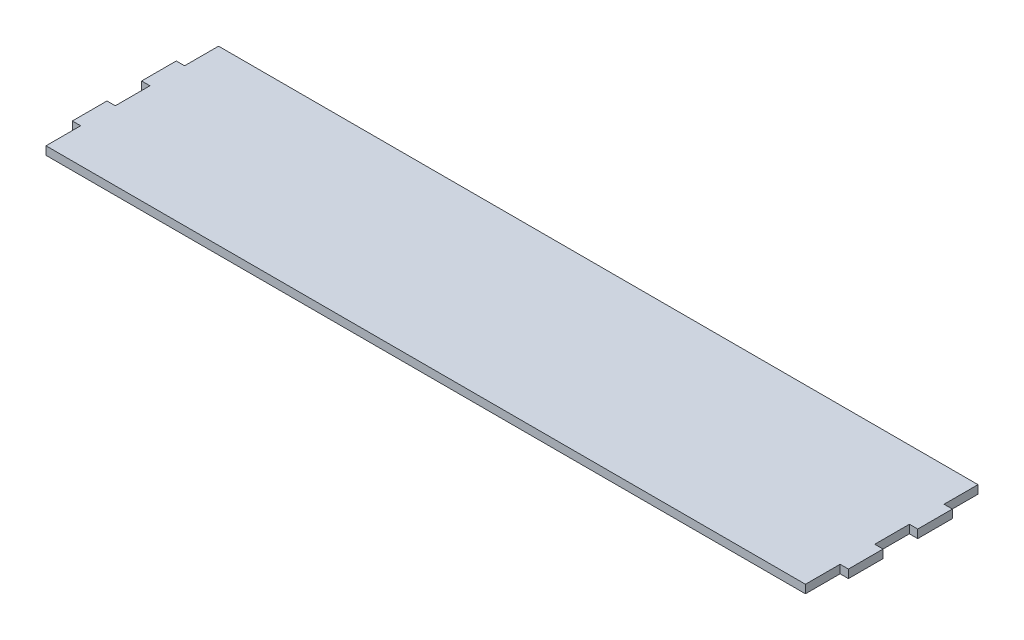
ISO-10303-21;
HEADER;
FILE_DESCRIPTION(('STEP AP214'),'2;1');
FILE_NAME('part.step','',(''),(''),'','','');
FILE_SCHEMA(('AUTOMOTIVE_DESIGN { 1 0 10303 214 1 1 1 1 }'));
ENDSEC;
DATA;
#1=APPLICATION_CONTEXT('core data for automotive mechanical design processes');
#2=APPLICATION_PROTOCOL_DEFINITION('international standard','automotive_design',2000,#1);
#3=PRODUCT_CONTEXT('',#1,'mechanical');
#4=PRODUCT('Part','Part','',(#3));
#5=PRODUCT_RELATED_PRODUCT_CATEGORY('part','',(#4));
#6=PRODUCT_DEFINITION_FORMATION('','',#4);
#7=PRODUCT_DEFINITION_CONTEXT('part definition',#1,'design');
#8=PRODUCT_DEFINITION('design','',#6,#7);
#9=PRODUCT_DEFINITION_SHAPE('','',#8);
#10=(LENGTH_UNIT() NAMED_UNIT(*) SI_UNIT(.MILLI.,.METRE.));
#11=(NAMED_UNIT(*) PLANE_ANGLE_UNIT() SI_UNIT($,.RADIAN.));
#12=(NAMED_UNIT(*) SI_UNIT($,.STERADIAN.) SOLID_ANGLE_UNIT());
#13=UNCERTAINTY_MEASURE_WITH_UNIT(LENGTH_MEASURE(1.E-05),#10,'distance_accuracy_value','');
#14=(GEOMETRIC_REPRESENTATION_CONTEXT(3) GLOBAL_UNCERTAINTY_ASSIGNED_CONTEXT((#13)) GLOBAL_UNIT_ASSIGNED_CONTEXT((#10,
#11,#12)) REPRESENTATION_CONTEXT('',''));
#15=CARTESIAN_POINT('',(0.,0.,0.));
#16=DIRECTION('',(0.,0.,1.));
#17=DIRECTION('',(1.,0.,0.));
#18=AXIS2_PLACEMENT_3D('',#15,#16,#17);
#19=CARTESIAN_POINT('',(548.,12.,-75.));
#20=DIRECTION('',(-1.,0.,0.));
#21=DIRECTION('',(0.,0.,1.));
#22=AXIS2_PLACEMENT_3D('',#19,#20,#21);
#23=PLANE('',#22);
#24=DIRECTION('',(0.,-1.,0.));
#25=VECTOR('',#24,1.);
#26=CARTESIAN_POINT('',(548.,12.,-124.));
#27=LINE('',#26,#25);
#28=CARTESIAN_POINT('',(548.,12.,-124.));
#29=VERTEX_POINT('',#28);
#30=CARTESIAN_POINT('',(548.,0.,-124.));
#31=VERTEX_POINT('',#30);
#32=EDGE_CURVE('E60',#29,#31,#27,.T.);
#33=ORIENTED_EDGE('',*,*,#32,.F.);
#34=DIRECTION('',(0.,0.,-1.));
#35=VECTOR('',#34,1.);
#36=CARTESIAN_POINT('',(548.,12.,-75.));
#37=LINE('',#36,#35);
#38=CARTESIAN_POINT('',(548.,12.,-75.));
#39=VERTEX_POINT('',#38);
#40=EDGE_CURVE('E276',#39,#29,#37,.T.);
#41=ORIENTED_EDGE('',*,*,#40,.F.);
#42=DIRECTION('',(0.,-1.,0.));
#43=VECTOR('',#42,1.);
#44=CARTESIAN_POINT('',(548.,12.,-75.));
#45=LINE('',#44,#43);
#46=CARTESIAN_POINT('',(548.,0.,-75.));
#47=VERTEX_POINT('',#46);
#48=EDGE_CURVE('E215',#39,#47,#45,.T.);
#49=ORIENTED_EDGE('',*,*,#48,.T.);
#50=DIRECTION('',(0.,0.,-1.));
#51=VECTOR('',#50,1.);
#52=CARTESIAN_POINT('',(548.,0.,-75.));
#53=LINE('',#52,#51);
#54=EDGE_CURVE('E219',#47,#31,#53,.T.);
#55=ORIENTED_EDGE('',*,*,#54,.T.);
#56=EDGE_LOOP('',(#33,#41,#49,#55));
#57=FACE_BOUND('',#56,.T.);
#58=ADVANCED_FACE('F45',(#57),#23,.F.);
#59=CARTESIAN_POINT('',(-548.,12.,-75.));
#60=DIRECTION('',(1.,0.,0.));
#61=DIRECTION('',(0.,0.,-1.));
#62=AXIS2_PLACEMENT_3D('',#59,#60,#61);
#63=PLANE('',#62);
#64=DIRECTION('',(0.,-1.,0.));
#65=VECTOR('',#64,1.);
#66=CARTESIAN_POINT('',(-548.,12.,-124.));
#67=LINE('',#66,#65);
#68=CARTESIAN_POINT('',(-548.,12.,-124.));
#69=VERTEX_POINT('',#68);
#70=CARTESIAN_POINT('',(-548.,0.,-124.));
#71=VERTEX_POINT('',#70);
#72=EDGE_CURVE('E224',#69,#71,#67,.T.);
#73=ORIENTED_EDGE('',*,*,#72,.T.);
#74=DIRECTION('',(0.,0.,1.));
#75=VECTOR('',#74,1.);
#76=CARTESIAN_POINT('',(-548.,0.,-75.));
#77=LINE('',#76,#75);
#78=CARTESIAN_POINT('',(-548.,0.,-75.));
#79=VERTEX_POINT('',#78);
#80=EDGE_CURVE('E223',#71,#79,#77,.T.);
#81=ORIENTED_EDGE('',*,*,#80,.T.);
#82=DIRECTION('',(0.,-1.,0.));
#83=VECTOR('',#82,1.);
#84=CARTESIAN_POINT('',(-548.,12.,-75.));
#85=LINE('',#84,#83);
#86=CARTESIAN_POINT('',(-548.,12.,-75.));
#87=VERTEX_POINT('',#86);
#88=EDGE_CURVE('E11',#87,#79,#85,.T.);
#89=ORIENTED_EDGE('',*,*,#88,.F.);
#90=DIRECTION('',(0.,0.,1.));
#91=VECTOR('',#90,1.);
#92=CARTESIAN_POINT('',(-548.,12.,-75.));
#93=LINE('',#92,#91);
#94=EDGE_CURVE('E140',#69,#87,#93,.T.);
#95=ORIENTED_EDGE('',*,*,#94,.F.);
#96=EDGE_LOOP('',(#73,#81,#89,#95));
#97=FACE_BOUND('',#96,.T.);
#98=ADVANCED_FACE('F419',(#97),#63,.F.);
#99=CARTESIAN_POINT('',(0.,12.,0.));
#100=DIRECTION('',(0.,-1.,0.));
#101=DIRECTION('',(0.,0.,-1.));
#102=AXIS2_PLACEMENT_3D('',#99,#100,#101);
#103=PLANE('',#102);
#104=DIRECTION('',(1.,0.,0.));
#105=VECTOR('',#104,1.);
#106=CARTESIAN_POINT('',(-548.,12.,-124.));
#107=LINE('',#106,#105);
#108=EDGE_CURVE('E424',#69,#29,#107,.T.);
#109=ORIENTED_EDGE('',*,*,#108,.F.);
#110=ORIENTED_EDGE('',*,*,#94,.T.);
#111=DIRECTION('',(-1.,0.,0.));
#112=VECTOR('',#111,1.);
#113=CARTESIAN_POINT('',(-548.,12.,-75.));
#114=LINE('',#113,#112);
#115=CARTESIAN_POINT('',(-560.,12.,-75.));
#116=VERTEX_POINT('',#115);
#117=EDGE_CURVE('E409',#87,#116,#114,.T.);
#118=ORIENTED_EDGE('',*,*,#117,.T.);
#119=DIRECTION('',(0.,0.,1.));
#120=VECTOR('',#119,1.);
#121=CARTESIAN_POINT('',(-560.,12.,-25.));
#122=LINE('',#121,#120);
#123=CARTESIAN_POINT('',(-560.,12.,-25.));
#124=VERTEX_POINT('',#123);
#125=EDGE_CURVE('E338',#116,#124,#122,.T.);
#126=ORIENTED_EDGE('',*,*,#125,.T.);
#127=DIRECTION('',(1.,0.,0.));
#128=VECTOR('',#127,1.);
#129=CARTESIAN_POINT('',(-548.,12.,-25.));
#130=LINE('',#129,#128);
#131=CARTESIAN_POINT('',(-548.,12.,-25.));
#132=VERTEX_POINT('',#131);
#133=EDGE_CURVE('E360',#124,#132,#130,.T.);
#134=ORIENTED_EDGE('',*,*,#133,.T.);
#135=DIRECTION('',(0.,0.,1.));
#136=VECTOR('',#135,1.);
#137=CARTESIAN_POINT('',(-547.999999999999,12.,25.));
#138=LINE('',#137,#136);
#139=CARTESIAN_POINT('',(-547.999999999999,12.,25.));
#140=VERTEX_POINT('',#139);
#141=EDGE_CURVE('E356',#132,#140,#138,.T.);
#142=ORIENTED_EDGE('',*,*,#141,.T.);
#143=DIRECTION('',(-1.,0.,0.));
#144=VECTOR('',#143,1.);
#145=CARTESIAN_POINT('',(-547.999999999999,12.,25.));
#146=LINE('',#145,#144);
#147=CARTESIAN_POINT('',(-560.,12.,25.));
#148=VERTEX_POINT('',#147);
#149=EDGE_CURVE('E359',#140,#148,#146,.T.);
#150=ORIENTED_EDGE('',*,*,#149,.T.);
#151=DIRECTION('',(0.,0.,1.));
#152=VECTOR('',#151,1.);
#153=CARTESIAN_POINT('',(-560.,12.,75.));
#154=LINE('',#153,#152);
#155=CARTESIAN_POINT('',(-560.,12.,75.));
#156=VERTEX_POINT('',#155);
#157=EDGE_CURVE('E364',#148,#156,#154,.T.);
#158=ORIENTED_EDGE('',*,*,#157,.T.);
#159=DIRECTION('',(1.,0.,0.));
#160=VECTOR('',#159,1.);
#161=CARTESIAN_POINT('',(-547.999999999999,12.,75.));
#162=LINE('',#161,#160);
#163=CARTESIAN_POINT('',(-547.999999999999,12.,75.));
#164=VERTEX_POINT('',#163);
#165=EDGE_CURVE('E371',#156,#164,#162,.T.);
#166=ORIENTED_EDGE('',*,*,#165,.T.);
#167=DIRECTION('',(0.,0.,1.));
#168=VECTOR('',#167,1.);
#169=CARTESIAN_POINT('',(-548.,12.,125.));
#170=LINE('',#169,#168);
#171=CARTESIAN_POINT('',(-548.,12.,125.));
#172=VERTEX_POINT('',#171);
#173=EDGE_CURVE('E374',#164,#172,#170,.T.);
#174=ORIENTED_EDGE('',*,*,#173,.T.);
#175=DIRECTION('',(1.,0.,0.));
#176=VECTOR('',#175,1.);
#177=CARTESIAN_POINT('',(-548.,12.,125.));
#178=LINE('',#177,#176);
#179=CARTESIAN_POINT('',(548.,12.,125.));
#180=VERTEX_POINT('',#179);
#181=EDGE_CURVE('E377',#172,#180,#178,.T.);
#182=ORIENTED_EDGE('',*,*,#181,.T.);
#183=DIRECTION('',(0.,0.,-1.));
#184=VECTOR('',#183,1.);
#185=CARTESIAN_POINT('',(548.,12.,125.));
#186=LINE('',#185,#184);
#187=CARTESIAN_POINT('',(547.999999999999,12.,75.));
#188=VERTEX_POINT('',#187);
#189=EDGE_CURVE('E380',#180,#188,#186,.T.);
#190=ORIENTED_EDGE('',*,*,#189,.T.);
#191=DIRECTION('',(1.,0.,0.));
#192=VECTOR('',#191,1.);
#193=CARTESIAN_POINT('',(547.999999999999,12.,75.));
#194=LINE('',#193,#192);
#195=CARTESIAN_POINT('',(560.,12.,75.));
#196=VERTEX_POINT('',#195);
#197=EDGE_CURVE('E383',#188,#196,#194,.T.);
#198=ORIENTED_EDGE('',*,*,#197,.T.);
#199=DIRECTION('',(0.,0.,-1.));
#200=VECTOR('',#199,1.);
#201=CARTESIAN_POINT('',(560.,12.,75.));
#202=LINE('',#201,#200);
#203=CARTESIAN_POINT('',(560.,12.,25.));
#204=VERTEX_POINT('',#203);
#205=EDGE_CURVE('E386',#196,#204,#202,.T.);
#206=ORIENTED_EDGE('',*,*,#205,.T.);
#207=DIRECTION('',(-1.,0.,0.));
#208=VECTOR('',#207,1.);
#209=CARTESIAN_POINT('',(547.999999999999,12.,25.));
#210=LINE('',#209,#208);
#211=CARTESIAN_POINT('',(547.999999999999,12.,25.));
#212=VERTEX_POINT('',#211);
#213=EDGE_CURVE('E389',#204,#212,#210,.T.);
#214=ORIENTED_EDGE('',*,*,#213,.T.);
#215=DIRECTION('',(0.,0.,-1.));
#216=VECTOR('',#215,1.);
#217=CARTESIAN_POINT('',(547.999999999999,12.,25.));
#218=LINE('',#217,#216);
#219=CARTESIAN_POINT('',(548.,12.,-25.));
#220=VERTEX_POINT('',#219);
#221=EDGE_CURVE('E194',#212,#220,#218,.T.);
#222=ORIENTED_EDGE('',*,*,#221,.T.);
#223=DIRECTION('',(1.,0.,0.));
#224=VECTOR('',#223,1.);
#225=CARTESIAN_POINT('',(548.,12.,-25.));
#226=LINE('',#225,#224);
#227=CARTESIAN_POINT('',(560.,12.,-25.));
#228=VERTEX_POINT('',#227);
#229=EDGE_CURVE('E187',#220,#228,#226,.T.);
#230=ORIENTED_EDGE('',*,*,#229,.T.);
#231=DIRECTION('',(0.,0.,-1.));
#232=VECTOR('',#231,1.);
#233=CARTESIAN_POINT('',(560.,12.,-25.));
#234=LINE('',#233,#232);
#235=CARTESIAN_POINT('',(560.,12.,-75.));
#236=VERTEX_POINT('',#235);
#237=EDGE_CURVE('E191',#228,#236,#234,.T.);
#238=ORIENTED_EDGE('',*,*,#237,.T.);
#239=DIRECTION('',(-1.,0.,0.));
#240=VECTOR('',#239,1.);
#241=CARTESIAN_POINT('',(548.,12.,-75.));
#242=LINE('',#241,#240);
#243=EDGE_CURVE('E69',#236,#39,#242,.T.);
#244=ORIENTED_EDGE('',*,*,#243,.T.);
#245=ORIENTED_EDGE('',*,*,#40,.T.);
#246=EDGE_LOOP('',(#109,#110,#118,#126,#134,#142,#150,#158,#166,#174,#182,#190,#198,#206,#214,
#222,#230,#238,#244,#245));
#247=FACE_BOUND('',#246,.T.);
#248=ADVANCED_FACE('F189',(#247),#103,.F.);
#249=CARTESIAN_POINT('',(0.,0.,0.));
#250=DIRECTION('',(0.,-1.,0.));
#251=DIRECTION('',(0.,0.,-1.));
#252=AXIS2_PLACEMENT_3D('',#249,#250,#251);
#253=PLANE('',#252);
#254=ORIENTED_EDGE('',*,*,#80,.F.);
#255=DIRECTION('',(1.,0.,0.));
#256=VECTOR('',#255,1.);
#257=CARTESIAN_POINT('',(-548.,0.,-124.));
#258=LINE('',#257,#256);
#259=EDGE_CURVE('E422',#71,#31,#258,.T.);
#260=ORIENTED_EDGE('',*,*,#259,.T.);
#261=ORIENTED_EDGE('',*,*,#54,.F.);
#262=DIRECTION('',(-1.,0.,0.));
#263=VECTOR('',#262,1.);
#264=CARTESIAN_POINT('',(548.,0.,-75.));
#265=LINE('',#264,#263);
#266=CARTESIAN_POINT('',(560.,0.,-75.));
#267=VERTEX_POINT('',#266);
#268=EDGE_CURVE('E132',#267,#47,#265,.T.);
#269=ORIENTED_EDGE('',*,*,#268,.F.);
#270=DIRECTION('',(0.,0.,-1.));
#271=VECTOR('',#270,1.);
#272=CARTESIAN_POINT('',(560.,0.,-25.));
#273=LINE('',#272,#271);
#274=CARTESIAN_POINT('',(560.,0.,-25.));
#275=VERTEX_POINT('',#274);
#276=EDGE_CURVE('E271',#275,#267,#273,.T.);
#277=ORIENTED_EDGE('',*,*,#276,.F.);
#278=DIRECTION('',(1.,0.,0.));
#279=VECTOR('',#278,1.);
#280=CARTESIAN_POINT('',(548.,0.,-25.));
#281=LINE('',#280,#279);
#282=CARTESIAN_POINT('',(548.,0.,-25.));
#283=VERTEX_POINT('',#282);
#284=EDGE_CURVE('E204',#283,#275,#281,.T.);
#285=ORIENTED_EDGE('',*,*,#284,.F.);
#286=DIRECTION('',(0.,0.,-1.));
#287=VECTOR('',#286,1.);
#288=CARTESIAN_POINT('',(547.999999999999,0.,25.));
#289=LINE('',#288,#287);
#290=CARTESIAN_POINT('',(547.999999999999,0.,25.));
#291=VERTEX_POINT('',#290);
#292=EDGE_CURVE('E266',#291,#283,#289,.T.);
#293=ORIENTED_EDGE('',*,*,#292,.F.);
#294=DIRECTION('',(-1.,0.,0.));
#295=VECTOR('',#294,1.);
#296=CARTESIAN_POINT('',(547.999999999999,0.,25.));
#297=LINE('',#296,#295);
#298=CARTESIAN_POINT('',(560.,0.,25.));
#299=VERTEX_POINT('',#298);
#300=EDGE_CURVE('E263',#299,#291,#297,.T.);
#301=ORIENTED_EDGE('',*,*,#300,.F.);
#302=DIRECTION('',(0.,0.,-1.));
#303=VECTOR('',#302,1.);
#304=CARTESIAN_POINT('',(560.,0.,75.));
#305=LINE('',#304,#303);
#306=CARTESIAN_POINT('',(560.,0.,75.));
#307=VERTEX_POINT('',#306);
#308=EDGE_CURVE('E260',#307,#299,#305,.T.);
#309=ORIENTED_EDGE('',*,*,#308,.F.);
#310=DIRECTION('',(1.,0.,0.));
#311=VECTOR('',#310,1.);
#312=CARTESIAN_POINT('',(547.999999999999,0.,75.));
#313=LINE('',#312,#311);
#314=CARTESIAN_POINT('',(547.999999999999,0.,75.));
#315=VERTEX_POINT('',#314);
#316=EDGE_CURVE('E257',#315,#307,#313,.T.);
#317=ORIENTED_EDGE('',*,*,#316,.F.);
#318=DIRECTION('',(0.,0.,-1.));
#319=VECTOR('',#318,1.);
#320=CARTESIAN_POINT('',(548.,0.,125.));
#321=LINE('',#320,#319);
#322=CARTESIAN_POINT('',(548.,0.,125.));
#323=VERTEX_POINT('',#322);
#324=EDGE_CURVE('E254',#323,#315,#321,.T.);
#325=ORIENTED_EDGE('',*,*,#324,.F.);
#326=DIRECTION('',(1.,0.,0.));
#327=VECTOR('',#326,1.);
#328=CARTESIAN_POINT('',(-548.,0.,125.));
#329=LINE('',#328,#327);
#330=CARTESIAN_POINT('',(-548.,0.,125.));
#331=VERTEX_POINT('',#330);
#332=EDGE_CURVE('E251',#331,#323,#329,.T.);
#333=ORIENTED_EDGE('',*,*,#332,.F.);
#334=DIRECTION('',(0.,0.,1.));
#335=VECTOR('',#334,1.);
#336=CARTESIAN_POINT('',(-548.,0.,125.));
#337=LINE('',#336,#335);
#338=CARTESIAN_POINT('',(-547.999999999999,0.,75.));
#339=VERTEX_POINT('',#338);
#340=EDGE_CURVE('E248',#339,#331,#337,.T.);
#341=ORIENTED_EDGE('',*,*,#340,.F.);
#342=DIRECTION('',(1.,0.,0.));
#343=VECTOR('',#342,1.);
#344=CARTESIAN_POINT('',(-547.999999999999,0.,75.));
#345=LINE('',#344,#343);
#346=CARTESIAN_POINT('',(-560.,0.,75.));
#347=VERTEX_POINT('',#346);
#348=EDGE_CURVE('E245',#347,#339,#345,.T.);
#349=ORIENTED_EDGE('',*,*,#348,.F.);
#350=DIRECTION('',(0.,0.,1.));
#351=VECTOR('',#350,1.);
#352=CARTESIAN_POINT('',(-560.,0.,75.));
#353=LINE('',#352,#351);
#354=CARTESIAN_POINT('',(-560.,0.,25.));
#355=VERTEX_POINT('',#354);
#356=EDGE_CURVE('E242',#355,#347,#353,.T.);
#357=ORIENTED_EDGE('',*,*,#356,.F.);
#358=DIRECTION('',(-1.,0.,0.));
#359=VECTOR('',#358,1.);
#360=CARTESIAN_POINT('',(-547.999999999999,0.,25.));
#361=LINE('',#360,#359);
#362=CARTESIAN_POINT('',(-547.999999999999,0.,25.));
#363=VERTEX_POINT('',#362);
#364=EDGE_CURVE('E239',#363,#355,#361,.T.);
#365=ORIENTED_EDGE('',*,*,#364,.F.);
#366=DIRECTION('',(0.,0.,1.));
#367=VECTOR('',#366,1.);
#368=CARTESIAN_POINT('',(-547.999999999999,0.,25.));
#369=LINE('',#368,#367);
#370=CARTESIAN_POINT('',(-548.,0.,-25.));
#371=VERTEX_POINT('',#370);
#372=EDGE_CURVE('E236',#371,#363,#369,.T.);
#373=ORIENTED_EDGE('',*,*,#372,.F.);
#374=DIRECTION('',(1.,0.,0.));
#375=VECTOR('',#374,1.);
#376=CARTESIAN_POINT('',(-548.,0.,-25.));
#377=LINE('',#376,#375);
#378=CARTESIAN_POINT('',(-560.,0.,-25.));
#379=VERTEX_POINT('',#378);
#380=EDGE_CURVE('E233',#379,#371,#377,.T.);
#381=ORIENTED_EDGE('',*,*,#380,.F.);
#382=DIRECTION('',(0.,0.,1.));
#383=VECTOR('',#382,1.);
#384=CARTESIAN_POINT('',(-560.,0.,-25.));
#385=LINE('',#384,#383);
#386=CARTESIAN_POINT('',(-560.,0.,-75.));
#387=VERTEX_POINT('',#386);
#388=EDGE_CURVE('E230',#387,#379,#385,.T.);
#389=ORIENTED_EDGE('',*,*,#388,.F.);
#390=DIRECTION('',(-1.,0.,0.));
#391=VECTOR('',#390,1.);
#392=CARTESIAN_POINT('',(-548.,0.,-75.));
#393=LINE('',#392,#391);
#394=EDGE_CURVE('E227',#79,#387,#393,.T.);
#395=ORIENTED_EDGE('',*,*,#394,.F.);
#396=EDGE_LOOP('',(#254,#260,#261,#269,#277,#285,#293,#301,#309,#317,#325,#333,#341,#349,#357,
#365,#373,#381,#389,#395));
#397=FACE_BOUND('',#396,.T.);
#398=ADVANCED_FACE('F345',(#397),#253,.T.);
#399=CARTESIAN_POINT('',(-548.,12.,-75.));
#400=DIRECTION('',(0.,0.,1.));
#401=DIRECTION('',(1.,0.,0.));
#402=AXIS2_PLACEMENT_3D('',#399,#400,#401);
#403=PLANE('',#402);
#404=ORIENTED_EDGE('',*,*,#394,.T.);
#405=DIRECTION('',(0.,-1.,0.));
#406=VECTOR('',#405,1.);
#407=CARTESIAN_POINT('',(-560.,12.,-75.));
#408=LINE('',#407,#406);
#409=EDGE_CURVE('E53',#116,#387,#408,.T.);
#410=ORIENTED_EDGE('',*,*,#409,.F.);
#411=ORIENTED_EDGE('',*,*,#117,.F.);
#412=ORIENTED_EDGE('',*,*,#88,.T.);
#413=EDGE_LOOP('',(#404,#410,#411,#412));
#414=FACE_BOUND('',#413,.T.);
#415=ADVANCED_FACE('F416',(#414),#403,.F.);
#416=CARTESIAN_POINT('',(-560.,12.,-25.));
#417=DIRECTION('',(1.,0.,0.));
#418=DIRECTION('',(0.,0.,-1.));
#419=AXIS2_PLACEMENT_3D('',#416,#417,#418);
#420=PLANE('',#419);
#421=ORIENTED_EDGE('',*,*,#388,.T.);
#422=DIRECTION('',(0.,-1.,0.));
#423=VECTOR('',#422,1.);
#424=CARTESIAN_POINT('',(-560.,12.,-25.));
#425=LINE('',#424,#423);
#426=EDGE_CURVE('E327',#124,#379,#425,.T.);
#427=ORIENTED_EDGE('',*,*,#426,.F.);
#428=ORIENTED_EDGE('',*,*,#125,.F.);
#429=ORIENTED_EDGE('',*,*,#409,.T.);
#430=EDGE_LOOP('',(#421,#427,#428,#429));
#431=FACE_BOUND('',#430,.T.);
#432=ADVANCED_FACE('F336',(#431),#420,.F.);
#433=CARTESIAN_POINT('',(-548.,12.,-25.));
#434=DIRECTION('',(0.,0.,-1.));
#435=DIRECTION('',(-1.,0.,0.));
#436=AXIS2_PLACEMENT_3D('',#433,#434,#435);
#437=PLANE('',#436);
#438=ORIENTED_EDGE('',*,*,#380,.T.);
#439=DIRECTION('',(0.,-1.,0.));
#440=VECTOR('',#439,1.);
#441=CARTESIAN_POINT('',(-548.,12.,-25.));
#442=LINE('',#441,#440);
#443=EDGE_CURVE('E323',#132,#371,#442,.T.);
#444=ORIENTED_EDGE('',*,*,#443,.F.);
#445=ORIENTED_EDGE('',*,*,#133,.F.);
#446=ORIENTED_EDGE('',*,*,#426,.T.);
#447=EDGE_LOOP('',(#438,#444,#445,#446));
#448=FACE_BOUND('',#447,.T.);
#449=ADVANCED_FACE('F350',(#448),#437,.F.);
#450=CARTESIAN_POINT('',(-547.999999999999,12.,25.));
#451=DIRECTION('',(1.,0.,0.));
#452=DIRECTION('',(0.,0.,-1.));
#453=AXIS2_PLACEMENT_3D('',#450,#451,#452);
#454=PLANE('',#453);
#455=ORIENTED_EDGE('',*,*,#372,.T.);
#456=DIRECTION('',(0.,-1.,0.));
#457=VECTOR('',#456,1.);
#458=CARTESIAN_POINT('',(-547.999999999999,12.,25.));
#459=LINE('',#458,#457);
#460=EDGE_CURVE('E319',#140,#363,#459,.T.);
#461=ORIENTED_EDGE('',*,*,#460,.F.);
#462=ORIENTED_EDGE('',*,*,#141,.F.);
#463=ORIENTED_EDGE('',*,*,#443,.T.);
#464=EDGE_LOOP('',(#455,#461,#462,#463));
#465=FACE_BOUND('',#464,.T.);
#466=ADVANCED_FACE('F354',(#465),#454,.F.);
#467=CARTESIAN_POINT('',(-547.999999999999,12.,25.));
#468=DIRECTION('',(0.,0.,1.));
#469=DIRECTION('',(1.,0.,0.));
#470=AXIS2_PLACEMENT_3D('',#467,#468,#469);
#471=PLANE('',#470);
#472=ORIENTED_EDGE('',*,*,#364,.T.);
#473=DIRECTION('',(0.,-1.,0.));
#474=VECTOR('',#473,1.);
#475=CARTESIAN_POINT('',(-560.,12.,25.));
#476=LINE('',#475,#474);
#477=EDGE_CURVE('E315',#148,#355,#476,.T.);
#478=ORIENTED_EDGE('',*,*,#477,.F.);
#479=ORIENTED_EDGE('',*,*,#149,.F.);
#480=ORIENTED_EDGE('',*,*,#460,.T.);
#481=EDGE_LOOP('',(#472,#478,#479,#480));
#482=FACE_BOUND('',#481,.T.);
#483=ADVANCED_FACE('F456',(#482),#471,.F.);
#484=CARTESIAN_POINT('',(-560.,12.,75.));
#485=DIRECTION('',(1.,0.,0.));
#486=DIRECTION('',(0.,0.,-1.));
#487=AXIS2_PLACEMENT_3D('',#484,#485,#486);
#488=PLANE('',#487);
#489=ORIENTED_EDGE('',*,*,#356,.T.);
#490=DIRECTION('',(0.,-1.,0.));
#491=VECTOR('',#490,1.);
#492=CARTESIAN_POINT('',(-560.,12.,75.));
#493=LINE('',#492,#491);
#494=EDGE_CURVE('E311',#156,#347,#493,.T.);
#495=ORIENTED_EDGE('',*,*,#494,.F.);
#496=ORIENTED_EDGE('',*,*,#157,.F.);
#497=ORIENTED_EDGE('',*,*,#477,.T.);
#498=EDGE_LOOP('',(#489,#495,#496,#497));
#499=FACE_BOUND('',#498,.T.);
#500=ADVANCED_FACE('F459',(#499),#488,.F.);
#501=CARTESIAN_POINT('',(-547.999999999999,12.,75.));
#502=DIRECTION('',(0.,0.,-1.));
#503=DIRECTION('',(-1.,0.,0.));
#504=AXIS2_PLACEMENT_3D('',#501,#502,#503);
#505=PLANE('',#504);
#506=ORIENTED_EDGE('',*,*,#348,.T.);
#507=DIRECTION('',(0.,-1.,0.));
#508=VECTOR('',#507,1.);
#509=CARTESIAN_POINT('',(-547.999999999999,12.,75.));
#510=LINE('',#509,#508);
#511=EDGE_CURVE('E307',#164,#339,#510,.T.);
#512=ORIENTED_EDGE('',*,*,#511,.F.);
#513=ORIENTED_EDGE('',*,*,#165,.F.);
#514=ORIENTED_EDGE('',*,*,#494,.T.);
#515=EDGE_LOOP('',(#506,#512,#513,#514));
#516=FACE_BOUND('',#515,.T.);
#517=ADVANCED_FACE('F463',(#516),#505,.F.);
#518=CARTESIAN_POINT('',(-548.,12.,125.));
#519=DIRECTION('',(1.,0.,0.));
#520=DIRECTION('',(0.,0.,-1.));
#521=AXIS2_PLACEMENT_3D('',#518,#519,#520);
#522=PLANE('',#521);
#523=ORIENTED_EDGE('',*,*,#340,.T.);
#524=DIRECTION('',(0.,-1.,0.));
#525=VECTOR('',#524,1.);
#526=CARTESIAN_POINT('',(-548.,12.,125.));
#527=LINE('',#526,#525);
#528=EDGE_CURVE('E303',#172,#331,#527,.T.);
#529=ORIENTED_EDGE('',*,*,#528,.F.);
#530=ORIENTED_EDGE('',*,*,#173,.F.);
#531=ORIENTED_EDGE('',*,*,#511,.T.);
#532=EDGE_LOOP('',(#523,#529,#530,#531));
#533=FACE_BOUND('',#532,.T.);
#534=ADVANCED_FACE('F467',(#533),#522,.F.);
#535=CARTESIAN_POINT('',(-548.,12.,125.));
#536=DIRECTION('',(0.,0.,-1.));
#537=DIRECTION('',(-1.,0.,0.));
#538=AXIS2_PLACEMENT_3D('',#535,#536,#537);
#539=PLANE('',#538);
#540=ORIENTED_EDGE('',*,*,#332,.T.);
#541=DIRECTION('',(0.,-1.,0.));
#542=VECTOR('',#541,1.);
#543=CARTESIAN_POINT('',(548.,12.,125.));
#544=LINE('',#543,#542);
#545=EDGE_CURVE('E299',#180,#323,#544,.T.);
#546=ORIENTED_EDGE('',*,*,#545,.F.);
#547=ORIENTED_EDGE('',*,*,#181,.F.);
#548=ORIENTED_EDGE('',*,*,#528,.T.);
#549=EDGE_LOOP('',(#540,#546,#547,#548));
#550=FACE_BOUND('',#549,.T.);
#551=ADVANCED_FACE('F471',(#550),#539,.F.);
#552=CARTESIAN_POINT('',(548.,12.,125.));
#553=DIRECTION('',(-1.,0.,0.));
#554=DIRECTION('',(0.,0.,1.));
#555=AXIS2_PLACEMENT_3D('',#552,#553,#554);
#556=PLANE('',#555);
#557=ORIENTED_EDGE('',*,*,#324,.T.);
#558=DIRECTION('',(0.,-1.,0.));
#559=VECTOR('',#558,1.);
#560=CARTESIAN_POINT('',(547.999999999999,12.,75.));
#561=LINE('',#560,#559);
#562=EDGE_CURVE('E295',#188,#315,#561,.T.);
#563=ORIENTED_EDGE('',*,*,#562,.F.);
#564=ORIENTED_EDGE('',*,*,#189,.F.);
#565=ORIENTED_EDGE('',*,*,#545,.T.);
#566=EDGE_LOOP('',(#557,#563,#564,#565));
#567=FACE_BOUND('',#566,.T.);
#568=ADVANCED_FACE('F475',(#567),#556,.F.);
#569=CARTESIAN_POINT('',(547.999999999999,12.,75.));
#570=DIRECTION('',(0.,0.,-1.));
#571=DIRECTION('',(-1.,0.,0.));
#572=AXIS2_PLACEMENT_3D('',#569,#570,#571);
#573=PLANE('',#572);
#574=ORIENTED_EDGE('',*,*,#316,.T.);
#575=DIRECTION('',(0.,-1.,0.));
#576=VECTOR('',#575,1.);
#577=CARTESIAN_POINT('',(560.,12.,75.));
#578=LINE('',#577,#576);
#579=EDGE_CURVE('E291',#196,#307,#578,.T.);
#580=ORIENTED_EDGE('',*,*,#579,.F.);
#581=ORIENTED_EDGE('',*,*,#197,.F.);
#582=ORIENTED_EDGE('',*,*,#562,.T.);
#583=EDGE_LOOP('',(#574,#580,#581,#582));
#584=FACE_BOUND('',#583,.T.);
#585=ADVANCED_FACE('F479',(#584),#573,.F.);
#586=CARTESIAN_POINT('',(560.,12.,75.));
#587=DIRECTION('',(-1.,0.,0.));
#588=DIRECTION('',(0.,0.,1.));
#589=AXIS2_PLACEMENT_3D('',#586,#587,#588);
#590=PLANE('',#589);
#591=ORIENTED_EDGE('',*,*,#308,.T.);
#592=DIRECTION('',(0.,-1.,0.));
#593=VECTOR('',#592,1.);
#594=CARTESIAN_POINT('',(560.,12.,25.));
#595=LINE('',#594,#593);
#596=EDGE_CURVE('E287',#204,#299,#595,.T.);
#597=ORIENTED_EDGE('',*,*,#596,.F.);
#598=ORIENTED_EDGE('',*,*,#205,.F.);
#599=ORIENTED_EDGE('',*,*,#579,.T.);
#600=EDGE_LOOP('',(#591,#597,#598,#599));
#601=FACE_BOUND('',#600,.T.);
#602=ADVANCED_FACE('F483',(#601),#590,.F.);
#603=CARTESIAN_POINT('',(547.999999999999,12.,25.));
#604=DIRECTION('',(0.,0.,1.));
#605=DIRECTION('',(1.,0.,0.));
#606=AXIS2_PLACEMENT_3D('',#603,#604,#605);
#607=PLANE('',#606);
#608=ORIENTED_EDGE('',*,*,#300,.T.);
#609=DIRECTION('',(0.,-1.,0.));
#610=VECTOR('',#609,1.);
#611=CARTESIAN_POINT('',(547.999999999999,12.,25.));
#612=LINE('',#611,#610);
#613=EDGE_CURVE('E283',#212,#291,#612,.T.);
#614=ORIENTED_EDGE('',*,*,#613,.F.);
#615=ORIENTED_EDGE('',*,*,#213,.F.);
#616=ORIENTED_EDGE('',*,*,#596,.T.);
#617=EDGE_LOOP('',(#608,#614,#615,#616));
#618=FACE_BOUND('',#617,.T.);
#619=ADVANCED_FACE('F397',(#618),#607,.F.);
#620=CARTESIAN_POINT('',(547.999999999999,12.,25.));
#621=DIRECTION('',(-1.,0.,0.));
#622=DIRECTION('',(0.,0.,1.));
#623=AXIS2_PLACEMENT_3D('',#620,#621,#622);
#624=PLANE('',#623);
#625=ORIENTED_EDGE('',*,*,#292,.T.);
#626=DIRECTION('',(0.,-1.,0.));
#627=VECTOR('',#626,1.);
#628=CARTESIAN_POINT('',(548.,12.,-25.));
#629=LINE('',#628,#627);
#630=EDGE_CURVE('E208',#220,#283,#629,.T.);
#631=ORIENTED_EDGE('',*,*,#630,.F.);
#632=ORIENTED_EDGE('',*,*,#221,.F.);
#633=ORIENTED_EDGE('',*,*,#613,.T.);
#634=EDGE_LOOP('',(#625,#631,#632,#633));
#635=FACE_BOUND('',#634,.T.);
#636=ADVANCED_FACE('F401',(#635),#624,.F.);
#637=CARTESIAN_POINT('',(548.,12.,-25.));
#638=DIRECTION('',(0.,0.,-1.));
#639=DIRECTION('',(-1.,0.,0.));
#640=AXIS2_PLACEMENT_3D('',#637,#638,#639);
#641=PLANE('',#640);
#642=ORIENTED_EDGE('',*,*,#284,.T.);
#643=DIRECTION('',(0.,-1.,0.));
#644=VECTOR('',#643,1.);
#645=CARTESIAN_POINT('',(560.,12.,-25.));
#646=LINE('',#645,#644);
#647=EDGE_CURVE('E201',#228,#275,#646,.T.);
#648=ORIENTED_EDGE('',*,*,#647,.F.);
#649=ORIENTED_EDGE('',*,*,#229,.F.);
#650=ORIENTED_EDGE('',*,*,#630,.T.);
#651=EDGE_LOOP('',(#642,#648,#649,#650));
#652=FACE_BOUND('',#651,.T.);
#653=ADVANCED_FACE('F202',(#652),#641,.F.);
#654=CARTESIAN_POINT('',(560.,12.,-25.));
#655=DIRECTION('',(-1.,0.,0.));
#656=DIRECTION('',(0.,0.,1.));
#657=AXIS2_PLACEMENT_3D('',#654,#655,#656);
#658=PLANE('',#657);
#659=ORIENTED_EDGE('',*,*,#276,.T.);
#660=DIRECTION('',(0.,-1.,0.));
#661=VECTOR('',#660,1.);
#662=CARTESIAN_POINT('',(560.,12.,-75.));
#663=LINE('',#662,#661);
#664=EDGE_CURVE('E209',#236,#267,#663,.T.);
#665=ORIENTED_EDGE('',*,*,#664,.F.);
#666=ORIENTED_EDGE('',*,*,#237,.F.);
#667=ORIENTED_EDGE('',*,*,#647,.T.);
#668=EDGE_LOOP('',(#659,#665,#666,#667));
#669=FACE_BOUND('',#668,.T.);
#670=ADVANCED_FACE('F211',(#669),#658,.F.);
#671=CARTESIAN_POINT('',(548.,12.,-75.));
#672=DIRECTION('',(0.,0.,1.));
#673=DIRECTION('',(1.,0.,0.));
#674=AXIS2_PLACEMENT_3D('',#671,#672,#673);
#675=PLANE('',#674);
#676=ORIENTED_EDGE('',*,*,#268,.T.);
#677=ORIENTED_EDGE('',*,*,#48,.F.);
#678=ORIENTED_EDGE('',*,*,#243,.F.);
#679=ORIENTED_EDGE('',*,*,#664,.T.);
#680=EDGE_LOOP('',(#676,#677,#678,#679));
#681=FACE_BOUND('',#680,.T.);
#682=ADVANCED_FACE('F403',(#681),#675,.F.);
#683=CARTESIAN_POINT('',(-548.,12.,-124.));
#684=DIRECTION('',(0.,0.,-1.));
#685=DIRECTION('',(-1.,0.,0.));
#686=AXIS2_PLACEMENT_3D('',#683,#684,#685);
#687=PLANE('',#686);
#688=ORIENTED_EDGE('',*,*,#259,.F.);
#689=ORIENTED_EDGE('',*,*,#72,.F.);
#690=ORIENTED_EDGE('',*,*,#108,.T.);
#691=ORIENTED_EDGE('',*,*,#32,.T.);
#692=EDGE_LOOP('',(#688,#689,#690,#691));
#693=FACE_BOUND('',#692,.T.);
#694=ADVANCED_FACE('F425',(#693),#687,.T.);
#695=CLOSED_SHELL('',(#58,#98,#248,#398,#415,#432,#449,#466,#483,#500,#517,#534,#551,#568,#585,
#602,#619,#636,#653,#670,#682,#694));
#696=MANIFOLD_SOLID_BREP('B2',#695);
#697=ADVANCED_BREP_SHAPE_REPRESENTATION('',(#18,#696),#14);
#698=SHAPE_DEFINITION_REPRESENTATION(#9,#697);
ENDSEC;
END-ISO-10303-21;
